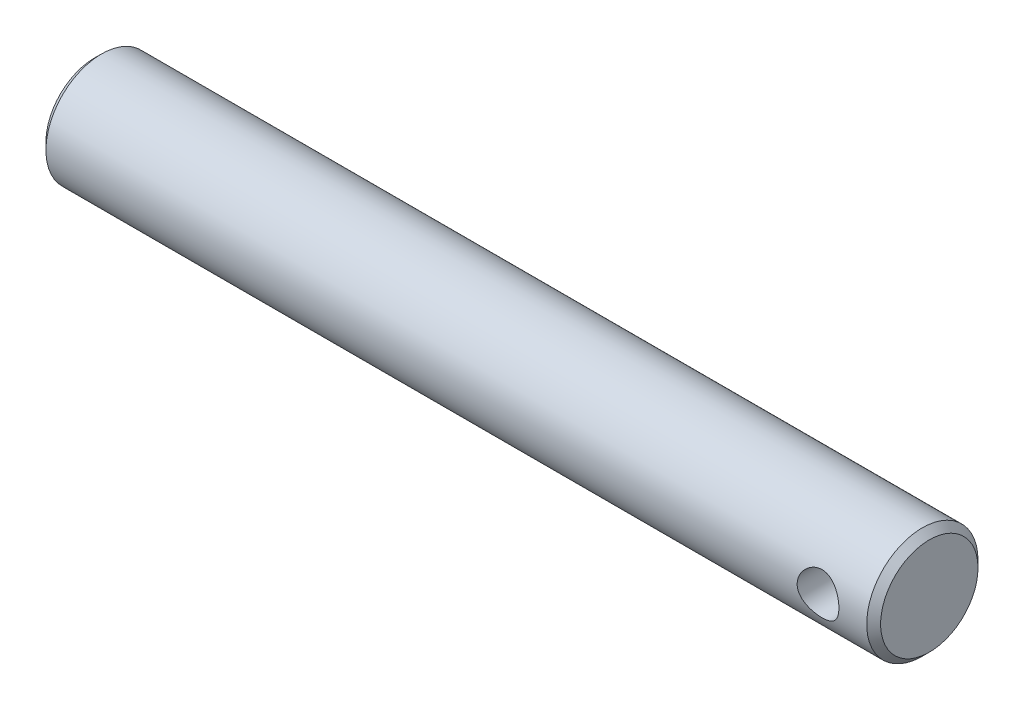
from build123d import *

# Parameters (mm, degrees)
SKETCH1_R               = 6.35
BASE_EXTRUDE_DEPTH      = 95.25
CUT_EXTRUDE1_DEPTH      = 96.672396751
CUT_EXTRUDE1_DEPTH_BACK = 96.672396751
SKETCH2_R               = 2.38125
SKETCH3_R               = 3.556
CUT_EXTRUDE2_DEPTH      = 31.75
CHAMFER1_SIZE           = 0.79375


with BuildPart() as part:
    # Sketch1 → Base-Extrude (new body)
    with BuildSketch(Plane(origin=(0, 0, 0), x_dir=(0, 0, -1), z_dir=(1, 0, 0))):
        Circle(SKETCH1_R)
    extrude(amount=BASE_EXTRUDE_DEPTH)

    # Sketch2 → Cut-Extrude1 (cut, two sides: drawn at the far end of the back side and taken through both)
    with BuildSketch(Plane.XY.offset(-CUT_EXTRUDE1_DEPTH_BACK)):
        with Locations((88.9, 0)):
            Circle(SKETCH2_R)
    extrude(amount=CUT_EXTRUDE1_DEPTH + CUT_EXTRUDE1_DEPTH_BACK, mode=Mode.SUBTRACT)

    # Sketch3 → Cut-Extrude2 (cut)
    with BuildSketch(Plane.ZY):
        Circle(SKETCH3_R)
    extrude(amount=-CUT_EXTRUDE2_DEPTH, mode=Mode.SUBTRACT)

    # Chamfer1
    chamfer1_edges = [part.edges().sort_by_distance(p)[0] for p in [
        (31.75, 0, -3.556),
        (0, 0, 6.35),
        (95.25, 0, 6.35),
    ]]
    chamfer(chamfer1_edges, length=CHAMFER1_SIZE)


solid = part.part
